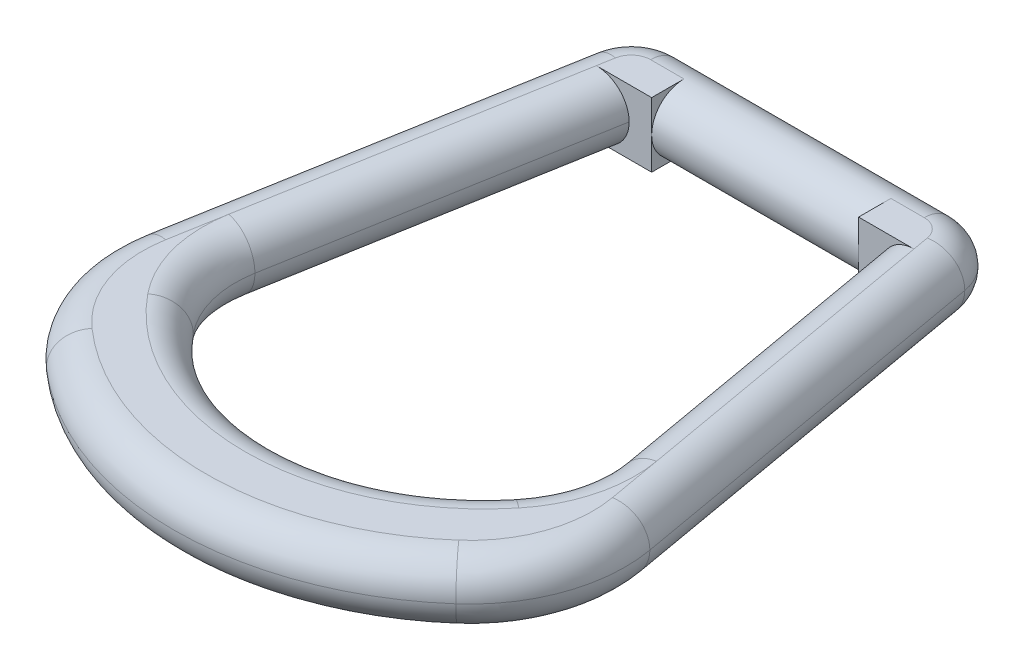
ISO-10303-21;
HEADER;
FILE_DESCRIPTION(('STEP AP214'),'2;1');
FILE_NAME('part.step','',(''),(''),'','','');
FILE_SCHEMA(('AUTOMOTIVE_DESIGN { 1 0 10303 214 1 1 1 1 }'));
ENDSEC;
DATA;
#1=APPLICATION_CONTEXT('core data for automotive mechanical design processes');
#2=APPLICATION_PROTOCOL_DEFINITION('international standard','automotive_design',2000,#1);
#3=PRODUCT_CONTEXT('',#1,'mechanical');
#4=PRODUCT('Part','Part','',(#3));
#5=PRODUCT_RELATED_PRODUCT_CATEGORY('part','',(#4));
#6=PRODUCT_DEFINITION_FORMATION('','',#4);
#7=PRODUCT_DEFINITION_CONTEXT('part definition',#1,'design');
#8=PRODUCT_DEFINITION('design','',#6,#7);
#9=PRODUCT_DEFINITION_SHAPE('','',#8);
#10=(LENGTH_UNIT() NAMED_UNIT(*) SI_UNIT(.MILLI.,.METRE.));
#11=(NAMED_UNIT(*) PLANE_ANGLE_UNIT() SI_UNIT($,.RADIAN.));
#12=(NAMED_UNIT(*) SI_UNIT($,.STERADIAN.) SOLID_ANGLE_UNIT());
#13=UNCERTAINTY_MEASURE_WITH_UNIT(LENGTH_MEASURE(1.E-05),#10,'distance_accuracy_value','');
#14=(GEOMETRIC_REPRESENTATION_CONTEXT(3) GLOBAL_UNCERTAINTY_ASSIGNED_CONTEXT((#13)) GLOBAL_UNIT_ASSIGNED_CONTEXT((#10,
#11,#12)) REPRESENTATION_CONTEXT('',''));
#15=CARTESIAN_POINT('',(0.,0.,0.));
#16=DIRECTION('',(0.,0.,1.));
#17=DIRECTION('',(1.,0.,0.));
#18=AXIS2_PLACEMENT_3D('',#15,#16,#17);
#19=CARTESIAN_POINT('',(12.8,-30.9,-25.7));
#20=DIRECTION('',(1.,0.,0.));
#21=DIRECTION('',(0.,1.,0.));
#22=AXIS2_PLACEMENT_3D('',#19,#20,#21);
#23=PLANE('',#22);
#24=DIRECTION('',(0.,0.,1.));
#25=VECTOR('',#24,1.);
#26=CARTESIAN_POINT('',(12.8,4.,10.));
#27=LINE('',#26,#25);
#28=CARTESIAN_POINT('',(12.8,4.,0.));
#29=VERTEX_POINT('',#28);
#30=CARTESIAN_POINT('',(12.8,4.,4.));
#31=VERTEX_POINT('',#30);
#32=EDGE_CURVE('E254',#29,#31,#27,.T.);
#33=ORIENTED_EDGE('',*,*,#32,.F.);
#34=CARTESIAN_POINT('',(12.8,0.,0.));
#35=DIRECTION('',(1.,0.,0.));
#36=DIRECTION('',(0.,1.,0.));
#37=AXIS2_PLACEMENT_3D('',#34,#35,#36);
#38=CIRCLE('',#37,4.);
#39=CARTESIAN_POINT('',(12.8,0.,4.));
#40=VERTEX_POINT('',#39);
#41=EDGE_CURVE('E31',#29,#40,#38,.T.);
#42=ORIENTED_EDGE('',*,*,#41,.T.);
#43=DIRECTION('',(0.,-1.,0.));
#44=VECTOR('',#43,1.);
#45=CARTESIAN_POINT('',(12.8,10.,4.));
#46=LINE('',#45,#44);
#47=EDGE_CURVE('E343',#31,#40,#46,.T.);
#48=ORIENTED_EDGE('',*,*,#47,.F.);
#49=EDGE_LOOP('',(#33,#42,#48));
#50=FACE_BOUND('',#49,.T.);
#51=ADVANCED_FACE('F14',(#50),#23,.F.);
#52=CARTESIAN_POINT('',(-12.8,-30.9,-25.7));
#53=DIRECTION('',(-1.,0.,0.));
#54=DIRECTION('',(0.,-1.,0.));
#55=AXIS2_PLACEMENT_3D('',#52,#53,#54);
#56=PLANE('',#55);
#57=CARTESIAN_POINT('',(-12.8,0.,0.));
#58=DIRECTION('',(1.,0.,0.));
#59=DIRECTION('',(0.,1.,0.));
#60=AXIS2_PLACEMENT_3D('',#57,#58,#59);
#61=CIRCLE('',#60,4.);
#62=CARTESIAN_POINT('',(-12.8,4.,0.));
#63=VERTEX_POINT('',#62);
#64=CARTESIAN_POINT('',(-12.8,0.,4.));
#65=VERTEX_POINT('',#64);
#66=EDGE_CURVE('E198',#63,#65,#61,.T.);
#67=ORIENTED_EDGE('',*,*,#66,.F.);
#68=DIRECTION('',(0.,0.,-1.));
#69=VECTOR('',#68,1.);
#70=CARTESIAN_POINT('',(-12.8,4.,10.));
#71=LINE('',#70,#69);
#72=CARTESIAN_POINT('',(-12.8,4.,4.));
#73=VERTEX_POINT('',#72);
#74=EDGE_CURVE('E209',#73,#63,#71,.T.);
#75=ORIENTED_EDGE('',*,*,#74,.F.);
#76=DIRECTION('',(0.,1.,0.));
#77=VECTOR('',#76,1.);
#78=CARTESIAN_POINT('',(-12.8,10.,4.));
#79=LINE('',#78,#77);
#80=EDGE_CURVE('E214',#65,#73,#79,.T.);
#81=ORIENTED_EDGE('',*,*,#80,.F.);
#82=EDGE_LOOP('',(#67,#75,#81));
#83=FACE_BOUND('',#82,.T.);
#84=ADVANCED_FACE('F217',(#83),#56,.F.);
#85=CARTESIAN_POINT('',(-12.8,-4.,0.));
#86=VERTEX_POINT('',#85);
#87=EDGE_CURVE('E23',#65,#86,#61,.T.);
#88=ORIENTED_EDGE('',*,*,#87,.F.);
#89=CARTESIAN_POINT('',(-12.8,-4.,4.));
#90=VERTEX_POINT('',#89);
#91=EDGE_CURVE('E239',#90,#65,#79,.T.);
#92=ORIENTED_EDGE('',*,*,#91,.F.);
#93=DIRECTION('',(0.,0.,-1.));
#94=VECTOR('',#93,1.);
#95=CARTESIAN_POINT('',(-12.8,-4.,10.));
#96=LINE('',#95,#94);
#97=EDGE_CURVE('E236',#90,#86,#96,.T.);
#98=ORIENTED_EDGE('',*,*,#97,.T.);
#99=EDGE_LOOP('',(#88,#92,#98));
#100=FACE_BOUND('',#99,.T.);
#101=ADVANCED_FACE('F534',(#100),#56,.F.);
#102=CARTESIAN_POINT('',(-16.9297623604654,-4.,2.4));
#103=DIRECTION('',(0.,-1.,0.));
#104=DIRECTION('',(1.,0.,0.));
#105=AXIS2_PLACEMENT_3D('',#102,#103,#104);
#106=PLANE('',#105);
#107=DIRECTION('',(-1.,0.,0.));
#108=VECTOR('',#107,1.);
#109=CARTESIAN_POINT('',(-15.5872029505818,-4.,4.));
#110=LINE('',#109,#108);
#111=CARTESIAN_POINT('',(-19.6489093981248,-4.,4.));
#112=VERTEX_POINT('',#111);
#113=EDGE_CURVE('E338',#90,#112,#110,.T.);
#114=ORIENTED_EDGE('',*,*,#113,.T.);
#115=DIRECTION('',(0.173648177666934,0.,-0.984807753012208));
#116=VECTOR('',#115,1.);
#117=CARTESIAN_POINT('',(-19.2933009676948,-4.,1.9832443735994));
#118=LINE('',#117,#116);
#119=CARTESIAN_POINT('',(-19.2933009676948,-4.,1.98324437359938));
#120=VERTEX_POINT('',#119);
#121=EDGE_CURVE('E271',#112,#120,#118,.T.);
#122=ORIENTED_EDGE('',*,*,#121,.T.);
#123=CARTESIAN_POINT('',(-16.9297623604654,-4.,2.4));
#124=DIRECTION('',(0.,-1.,0.));
#125=DIRECTION('',(1.,0.,0.));
#126=AXIS2_PLACEMENT_3D('',#123,#124,#125);
#127=CIRCLE('',#126,2.4);
#128=CARTESIAN_POINT('',(-16.9297623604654,-4.,0.));
#129=VERTEX_POINT('',#128);
#130=EDGE_CURVE('E246',#120,#129,#127,.T.);
#131=ORIENTED_EDGE('',*,*,#130,.T.);
#132=DIRECTION('',(1.,0.,0.));
#133=VECTOR('',#132,1.);
#134=CARTESIAN_POINT('',(-12.8,-4.,0.));
#135=LINE('',#134,#133);
#136=EDGE_CURVE('E242',#129,#86,#135,.T.);
#137=ORIENTED_EDGE('',*,*,#136,.T.);
#138=ORIENTED_EDGE('',*,*,#97,.F.);
#139=EDGE_LOOP('',(#114,#122,#131,#137,#138));
#140=FACE_BOUND('',#139,.T.);
#141=ADVANCED_FACE('F545',(#140),#106,.T.);
#142=DIRECTION('',(0.,0.,1.));
#143=VECTOR('',#142,1.);
#144=CARTESIAN_POINT('',(12.8,-4.,10.));
#145=LINE('',#144,#143);
#146=CARTESIAN_POINT('',(12.8,-4.,0.));
#147=VERTEX_POINT('',#146);
#148=CARTESIAN_POINT('',(12.8,-4.,4.));
#149=VERTEX_POINT('',#148);
#150=EDGE_CURVE('E215',#147,#149,#145,.T.);
#151=ORIENTED_EDGE('',*,*,#150,.F.);
#152=DIRECTION('',(1.,0.,0.));
#153=VECTOR('',#152,1.);
#154=CARTESIAN_POINT('',(16.9297623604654,-4.,0.));
#155=LINE('',#154,#153);
#156=CARTESIAN_POINT('',(16.9297623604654,-4.,0.));
#157=VERTEX_POINT('',#156);
#158=EDGE_CURVE('E270',#147,#157,#155,.T.);
#159=ORIENTED_EDGE('',*,*,#158,.T.);
#160=CARTESIAN_POINT('',(16.9297623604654,-4.,2.4));
#161=DIRECTION('',(0.,-1.,0.));
#162=DIRECTION('',(1.,0.,0.));
#163=AXIS2_PLACEMENT_3D('',#160,#161,#162);
#164=CIRCLE('',#163,2.4);
#165=CARTESIAN_POINT('',(19.2933009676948,-4.,1.98324437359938));
#166=VERTEX_POINT('',#165);
#167=EDGE_CURVE('E272',#157,#166,#164,.T.);
#168=ORIENTED_EDGE('',*,*,#167,.T.);
#169=DIRECTION('',(0.173648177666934,0.,0.984807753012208));
#170=VECTOR('',#169,1.);
#171=CARTESIAN_POINT('',(27.6348189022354,-4.,49.2903433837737));
#172=LINE('',#171,#170);
#173=CARTESIAN_POINT('',(19.6489093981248,-4.,4.));
#174=VERTEX_POINT('',#173);
#175=EDGE_CURVE('E278',#166,#174,#172,.T.);
#176=ORIENTED_EDGE('',*,*,#175,.T.);
#177=DIRECTION('',(-1.,0.,0.));
#178=VECTOR('',#177,1.);
#179=CARTESIAN_POINT('',(15.5872029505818,-4.,4.));
#180=LINE('',#179,#178);
#181=EDGE_CURVE('E257',#174,#149,#180,.T.);
#182=ORIENTED_EDGE('',*,*,#181,.T.);
#183=EDGE_LOOP('',(#151,#159,#168,#176,#182));
#184=FACE_BOUND('',#183,.T.);
#185=ADVANCED_FACE('F543',(#184),#106,.T.);
#186=CARTESIAN_POINT('',(-16.9297623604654,4.,2.4));
#187=DIRECTION('',(0.,-1.,0.));
#188=DIRECTION('',(1.,0.,0.));
#189=AXIS2_PLACEMENT_3D('',#186,#187,#188);
#190=PLANE('',#189);
#191=CARTESIAN_POINT('',(16.9297623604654,4.,2.4));
#192=DIRECTION('',(0.,-1.,0.));
#193=DIRECTION('',(1.,0.,0.));
#194=AXIS2_PLACEMENT_3D('',#191,#192,#193);
#195=CIRCLE('',#194,2.4);
#196=CARTESIAN_POINT('',(19.2933009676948,4.,1.98324437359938));
#197=VERTEX_POINT('',#196);
#198=CARTESIAN_POINT('',(16.9297623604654,4.,0.));
#199=VERTEX_POINT('',#198);
#200=EDGE_CURVE('E264',#197,#199,#195,.F.);
#201=ORIENTED_EDGE('',*,*,#200,.T.);
#202=DIRECTION('',(1.,0.,0.));
#203=VECTOR('',#202,1.);
#204=CARTESIAN_POINT('',(-16.9297623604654,4.,0.));
#205=LINE('',#204,#203);
#206=EDGE_CURVE('E260',#199,#29,#205,.F.);
#207=ORIENTED_EDGE('',*,*,#206,.T.);
#208=ORIENTED_EDGE('',*,*,#32,.T.);
#209=DIRECTION('',(-1.,0.,0.));
#210=VECTOR('',#209,1.);
#211=CARTESIAN_POINT('',(15.5872029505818,4.,4.));
#212=LINE('',#211,#210);
#213=CARTESIAN_POINT('',(19.6489093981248,4.,4.));
#214=VERTEX_POINT('',#213);
#215=EDGE_CURVE('E335',#214,#31,#212,.T.);
#216=ORIENTED_EDGE('',*,*,#215,.F.);
#217=DIRECTION('',(0.173648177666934,0.,0.984807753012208));
#218=VECTOR('',#217,1.);
#219=CARTESIAN_POINT('',(18.2723113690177,4.,-3.80707537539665));
#220=LINE('',#219,#218);
#221=EDGE_CURVE('E204',#214,#197,#220,.F.);
#222=ORIENTED_EDGE('',*,*,#221,.T.);
#223=EDGE_LOOP('',(#201,#207,#208,#216,#222));
#224=FACE_BOUND('',#223,.T.);
#225=ADVANCED_FACE('F525',(#224),#190,.F.);
#226=ORIENTED_EDGE('',*,*,#74,.T.);
#227=DIRECTION('',(1.,0.,0.));
#228=VECTOR('',#227,1.);
#229=CARTESIAN_POINT('',(-16.9297623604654,4.,0.));
#230=LINE('',#229,#228);
#231=CARTESIAN_POINT('',(-16.9297623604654,4.,0.));
#232=VERTEX_POINT('',#231);
#233=EDGE_CURVE('E193',#63,#232,#230,.F.);
#234=ORIENTED_EDGE('',*,*,#233,.T.);
#235=CARTESIAN_POINT('',(-16.9297623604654,4.,2.4));
#236=DIRECTION('',(0.,-1.,0.));
#237=DIRECTION('',(1.,0.,0.));
#238=AXIS2_PLACEMENT_3D('',#235,#236,#237);
#239=CIRCLE('',#238,2.4);
#240=CARTESIAN_POINT('',(-19.2933009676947,4.,1.98324437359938));
#241=VERTEX_POINT('',#240);
#242=EDGE_CURVE('E205',#232,#241,#239,.F.);
#243=ORIENTED_EDGE('',*,*,#242,.T.);
#244=DIRECTION('',(0.173648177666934,0.,-0.984807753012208));
#245=VECTOR('',#244,1.);
#246=CARTESIAN_POINT('',(-19.2933009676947,4.,1.98324437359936));
#247=LINE('',#246,#245);
#248=CARTESIAN_POINT('',(-19.6489093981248,4.,4.));
#249=VERTEX_POINT('',#248);
#250=EDGE_CURVE('E363',#241,#249,#247,.F.);
#251=ORIENTED_EDGE('',*,*,#250,.T.);
#252=DIRECTION('',(-1.,0.,0.));
#253=VECTOR('',#252,1.);
#254=CARTESIAN_POINT('',(-15.5872029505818,4.,4.));
#255=LINE('',#254,#253);
#256=EDGE_CURVE('E212',#73,#249,#255,.T.);
#257=ORIENTED_EDGE('',*,*,#256,.F.);
#258=EDGE_LOOP('',(#226,#234,#243,#251,#257));
#259=FACE_BOUND('',#258,.T.);
#260=ADVANCED_FACE('F210',(#259),#190,.F.);
#261=CARTESIAN_POINT('',(15.5872029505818,-4.,4.));
#262=DIRECTION('',(0.,0.,-1.));
#263=DIRECTION('',(0.,-1.,0.));
#264=AXIS2_PLACEMENT_3D('',#261,#262,#263);
#265=PLANE('',#264);
#266=ORIENTED_EDGE('',*,*,#215,.T.);
#267=ORIENTED_EDGE('',*,*,#47,.T.);
#268=EDGE_CURVE('E238',#40,#149,#46,.T.);
#269=ORIENTED_EDGE('',*,*,#268,.T.);
#270=ORIENTED_EDGE('',*,*,#181,.F.);
#271=CARTESIAN_POINT('',(19.6489093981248,0.,4.));
#272=DIRECTION('',(0.,0.,-1.));
#273=DIRECTION('',(1.,0.,0.));
#274=AXIS2_PLACEMENT_3D('',#271,#272,#273);
#275=ELLIPSE('',#274,4.06170644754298,4.);
#276=CARTESIAN_POINT('',(15.5872029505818,0.,4.));
#277=VERTEX_POINT('',#276);
#278=EDGE_CURVE('E291',#174,#277,#275,.T.);
#279=ORIENTED_EDGE('',*,*,#278,.T.);
#280=CARTESIAN_POINT('',(19.6489093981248,0.,4.));
#281=DIRECTION('',(0.,0.,-1.));
#282=DIRECTION('',(-1.,0.,0.));
#283=AXIS2_PLACEMENT_3D('',#280,#281,#282);
#284=ELLIPSE('',#283,4.06170644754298,4.);
#285=EDGE_CURVE('E289',#277,#214,#284,.T.);
#286=ORIENTED_EDGE('',*,*,#285,.T.);
#287=EDGE_LOOP('',(#266,#267,#269,#270,#279,#286));
#288=FACE_BOUND('',#287,.T.);
#289=ADVANCED_FACE('F523',(#288),#265,.F.);
#290=CARTESIAN_POINT('',(-15.5872029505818,-4.,4.));
#291=DIRECTION('',(0.,0.,-1.));
#292=DIRECTION('',(0.,-1.,0.));
#293=AXIS2_PLACEMENT_3D('',#290,#291,#292);
#294=PLANE('',#293);
#295=ORIENTED_EDGE('',*,*,#113,.F.);
#296=ORIENTED_EDGE('',*,*,#91,.T.);
#297=ORIENTED_EDGE('',*,*,#80,.T.);
#298=ORIENTED_EDGE('',*,*,#256,.T.);
#299=CARTESIAN_POINT('',(-19.6489093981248,0.,4.));
#300=DIRECTION('',(0.,0.,-1.));
#301=DIRECTION('',(-1.,0.,0.));
#302=AXIS2_PLACEMENT_3D('',#299,#300,#301);
#303=ELLIPSE('',#302,4.06170644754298,4.);
#304=CARTESIAN_POINT('',(-15.5872029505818,0.,4.));
#305=VERTEX_POINT('',#304);
#306=EDGE_CURVE('E227',#249,#305,#303,.T.);
#307=ORIENTED_EDGE('',*,*,#306,.T.);
#308=CARTESIAN_POINT('',(-19.6489093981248,0.,4.));
#309=DIRECTION('',(0.,0.,-1.));
#310=DIRECTION('',(1.,0.,0.));
#311=AXIS2_PLACEMENT_3D('',#308,#309,#310);
#312=ELLIPSE('',#311,4.06170644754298,4.);
#313=EDGE_CURVE('E245',#305,#112,#312,.T.);
#314=ORIENTED_EDGE('',*,*,#313,.T.);
#315=EDGE_LOOP('',(#295,#296,#297,#298,#307,#314));
#316=FACE_BOUND('',#315,.T.);
#317=ADVANCED_FACE('F16',(#316),#294,.F.);
#318=CARTESIAN_POINT('',(0.,-4.,37.5));
#319=DIRECTION('',(0.,-1.,0.));
#320=DIRECTION('',(1.,0.,0.));
#321=AXIS2_PLACEMENT_3D('',#318,#319,#320);
#322=CIRCLE('',#321,34.4);
#323=CARTESIAN_POINT('',(22.6927860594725,-4.,63.3533839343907));
#324=VERTEX_POINT('',#323);
#325=CARTESIAN_POINT('',(-22.6927860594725,-4.,63.3533839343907));
#326=VERTEX_POINT('',#325);
#327=EDGE_CURVE('E373',#324,#326,#322,.T.);
#328=ORIENTED_EDGE('',*,*,#327,.T.);
#329=CARTESIAN_POINT('',(-12.6657410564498,-4.,51.9297956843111));
#330=DIRECTION('',(0.,-1.,0.));
#331=DIRECTION('',(1.,0.,0.));
#332=AXIS2_PLACEMENT_3D('',#329,#330,#331);
#333=CIRCLE('',#332,15.2);
#334=CARTESIAN_POINT('',(-27.6348189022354,-4.,49.2903433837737));
#335=VERTEX_POINT('',#334);
#336=EDGE_CURVE('E282',#326,#335,#333,.T.);
#337=ORIENTED_EDGE('',*,*,#336,.T.);
#338=DIRECTION('',(0.173648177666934,0.,-0.984807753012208));
#339=VECTOR('',#338,1.);
#340=CARTESIAN_POINT('',(-19.2933009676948,-4.,1.9832443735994));
#341=LINE('',#340,#339);
#342=CARTESIAN_POINT('',(-26.4672559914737,-4.,42.6687650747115));
#343=VERTEX_POINT('',#342);
#344=EDGE_CURVE('E380',#335,#343,#341,.T.);
#345=ORIENTED_EDGE('',*,*,#344,.T.);
#346=CARTESIAN_POINT('',(-9.92248574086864,-4.,45.586054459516));
#347=DIRECTION('',(0.,-1.,0.));
#348=DIRECTION('',(1.,0.,0.));
#349=AXIS2_PLACEMENT_3D('',#346,#347,#348);
#350=CIRCLE('',#349,16.8);
#351=CARTESIAN_POINT('',(-22.9457482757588,-4.,56.1990009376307));
#352=VERTEX_POINT('',#351);
#353=EDGE_CURVE('E377',#343,#352,#350,.F.);
#354=ORIENTED_EDGE('',*,*,#353,.T.);
#355=CARTESIAN_POINT('',(0.,-4.,37.5));
#356=DIRECTION('',(0.,-1.,0.));
#357=DIRECTION('',(1.,0.,0.));
#358=AXIS2_PLACEMENT_3D('',#355,#356,#357);
#359=CIRCLE('',#358,29.6);
#360=CARTESIAN_POINT('',(22.9457482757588,-4.,56.1990009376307));
#361=VERTEX_POINT('',#360);
#362=EDGE_CURVE('E375',#352,#361,#359,.F.);
#363=ORIENTED_EDGE('',*,*,#362,.T.);
#364=CARTESIAN_POINT('',(9.92248574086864,-4.,45.586054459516));
#365=DIRECTION('',(0.,-1.,0.));
#366=DIRECTION('',(1.,0.,0.));
#367=AXIS2_PLACEMENT_3D('',#364,#365,#366);
#368=CIRCLE('',#367,16.8);
#369=CARTESIAN_POINT('',(26.4672559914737,-4.,42.6687650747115));
#370=VERTEX_POINT('',#369);
#371=EDGE_CURVE('E371',#361,#370,#368,.F.);
#372=ORIENTED_EDGE('',*,*,#371,.T.);
#373=DIRECTION('',(0.173648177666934,0.,0.984807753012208));
#374=VECTOR('',#373,1.);
#375=CARTESIAN_POINT('',(27.6348189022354,-4.,49.2903433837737));
#376=LINE('',#375,#374);
#377=CARTESIAN_POINT('',(27.6348189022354,-4.,49.2903433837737));
#378=VERTEX_POINT('',#377);
#379=EDGE_CURVE('E263',#370,#378,#376,.T.);
#380=ORIENTED_EDGE('',*,*,#379,.T.);
#381=CARTESIAN_POINT('',(12.6657410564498,-4.,51.9297956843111));
#382=DIRECTION('',(0.,-1.,0.));
#383=DIRECTION('',(1.,0.,0.));
#384=AXIS2_PLACEMENT_3D('',#381,#382,#383);
#385=CIRCLE('',#384,15.2);
#386=EDGE_CURVE('E369',#378,#324,#385,.T.);
#387=ORIENTED_EDGE('',*,*,#386,.T.);
#388=EDGE_LOOP('',(#328,#337,#345,#354,#363,#372,#380,#387));
#389=FACE_BOUND('',#388,.T.);
#390=ADVANCED_FACE('F384',(#389),#106,.T.);
#391=DIRECTION('',(0.173648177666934,0.,0.984807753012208));
#392=VECTOR('',#391,1.);
#393=CARTESIAN_POINT('',(18.2723113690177,4.,-3.80707537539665));
#394=LINE('',#393,#392);
#395=CARTESIAN_POINT('',(27.6348189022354,4.,49.2903433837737));
#396=VERTEX_POINT('',#395);
#397=CARTESIAN_POINT('',(26.4672559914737,4.,42.6687650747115));
#398=VERTEX_POINT('',#397);
#399=EDGE_CURVE('E358',#396,#398,#394,.F.);
#400=ORIENTED_EDGE('',*,*,#399,.T.);
#401=CARTESIAN_POINT('',(9.92248574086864,4.,45.586054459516));
#402=DIRECTION('',(0.,-1.,0.));
#403=DIRECTION('',(1.,0.,0.));
#404=AXIS2_PLACEMENT_3D('',#401,#402,#403);
#405=CIRCLE('',#404,16.8);
#406=CARTESIAN_POINT('',(22.9457482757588,4.,56.1990009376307));
#407=VERTEX_POINT('',#406);
#408=EDGE_CURVE('E361',#398,#407,#405,.T.);
#409=ORIENTED_EDGE('',*,*,#408,.T.);
#410=CARTESIAN_POINT('',(0.,4.,37.5));
#411=DIRECTION('',(0.,-1.,0.));
#412=DIRECTION('',(1.,0.,0.));
#413=AXIS2_PLACEMENT_3D('',#410,#411,#412);
#414=CIRCLE('',#413,29.6);
#415=CARTESIAN_POINT('',(-22.9457482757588,4.,56.1990009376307));
#416=VERTEX_POINT('',#415);
#417=EDGE_CURVE('E354',#407,#416,#414,.T.);
#418=ORIENTED_EDGE('',*,*,#417,.T.);
#419=CARTESIAN_POINT('',(-9.92248574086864,4.,45.586054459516));
#420=DIRECTION('',(0.,-1.,0.));
#421=DIRECTION('',(1.,0.,0.));
#422=AXIS2_PLACEMENT_3D('',#419,#420,#421);
#423=CIRCLE('',#422,16.8);
#424=CARTESIAN_POINT('',(-26.4672559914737,4.,42.6687650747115));
#425=VERTEX_POINT('',#424);
#426=EDGE_CURVE('E350',#416,#425,#423,.T.);
#427=ORIENTED_EDGE('',*,*,#426,.T.);
#428=DIRECTION('',(0.173648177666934,0.,-0.984807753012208));
#429=VECTOR('',#428,1.);
#430=CARTESIAN_POINT('',(-19.2933009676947,4.,1.98324437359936));
#431=LINE('',#430,#429);
#432=CARTESIAN_POINT('',(-27.6348189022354,4.,49.2903433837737));
#433=VERTEX_POINT('',#432);
#434=EDGE_CURVE('E346',#425,#433,#431,.F.);
#435=ORIENTED_EDGE('',*,*,#434,.T.);
#436=CARTESIAN_POINT('',(-12.6657410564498,4.,51.9297956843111));
#437=DIRECTION('',(0.,-1.,0.));
#438=DIRECTION('',(1.,0.,0.));
#439=AXIS2_PLACEMENT_3D('',#436,#437,#438);
#440=CIRCLE('',#439,15.2);
#441=CARTESIAN_POINT('',(-22.6927860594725,4.,63.3533839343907));
#442=VERTEX_POINT('',#441);
#443=EDGE_CURVE('E348',#433,#442,#440,.F.);
#444=ORIENTED_EDGE('',*,*,#443,.T.);
#445=CARTESIAN_POINT('',(0.,4.,37.5));
#446=DIRECTION('',(0.,-1.,0.));
#447=DIRECTION('',(1.,0.,0.));
#448=AXIS2_PLACEMENT_3D('',#445,#446,#447);
#449=CIRCLE('',#448,34.4);
#450=CARTESIAN_POINT('',(22.6927860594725,4.,63.3533839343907));
#451=VERTEX_POINT('',#450);
#452=EDGE_CURVE('E352',#442,#451,#449,.F.);
#453=ORIENTED_EDGE('',*,*,#452,.T.);
#454=CARTESIAN_POINT('',(12.6657410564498,4.,51.9297956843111));
#455=DIRECTION('',(0.,-1.,0.));
#456=DIRECTION('',(1.,0.,0.));
#457=AXIS2_PLACEMENT_3D('',#454,#455,#456);
#458=CIRCLE('',#457,15.2);
#459=EDGE_CURVE('E356',#451,#396,#458,.F.);
#460=ORIENTED_EDGE('',*,*,#459,.T.);
#461=EDGE_LOOP('',(#400,#409,#418,#427,#435,#444,#453,#460));
#462=FACE_BOUND('',#461,.T.);
#463=ADVANCED_FACE('F553',(#462),#190,.F.);
#464=CARTESIAN_POINT('',(-16.9297623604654,0.,0.));
#465=DIRECTION('',(-1.,0.,0.));
#466=DIRECTION('',(0.,-1.,0.));
#467=AXIS2_PLACEMENT_3D('',#464,#465,#466);
#468=CYLINDRICAL_SURFACE('',#467,4.);
#469=DIRECTION('',(1.,0.,0.));
#470=VECTOR('',#469,1.);
#471=CARTESIAN_POINT('',(-16.9297623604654,0.,-4.));
#472=LINE('',#471,#470);
#473=CARTESIAN_POINT('',(-12.8,0.,-4.));
#474=VERTEX_POINT('',#473);
#475=CARTESIAN_POINT('',(-16.9297623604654,0.,-4.));
#476=VERTEX_POINT('',#475);
#477=EDGE_CURVE('E330',#474,#476,#472,.F.);
#478=ORIENTED_EDGE('',*,*,#477,.F.);
#479=ORIENTED_EDGE('',*,*,#477,.T.);
#480=CARTESIAN_POINT('',(-16.9297623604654,0.,0.));
#481=DIRECTION('',(-1.,0.,0.));
#482=DIRECTION('',(0.,-1.,0.));
#483=AXIS2_PLACEMENT_3D('',#480,#481,#482);
#484=CIRCLE('',#483,4.);
#485=EDGE_CURVE('E201',#232,#476,#484,.T.);
#486=ORIENTED_EDGE('',*,*,#485,.F.);
#487=ORIENTED_EDGE('',*,*,#233,.F.);
#488=ORIENTED_EDGE('',*,*,#66,.T.);
#489=ORIENTED_EDGE('',*,*,#87,.T.);
#490=ORIENTED_EDGE('',*,*,#136,.F.);
#491=CARTESIAN_POINT('',(-16.9297623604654,0.,0.));
#492=DIRECTION('',(-1.,0.,0.));
#493=DIRECTION('',(0.,-1.,0.));
#494=AXIS2_PLACEMENT_3D('',#491,#492,#493);
#495=CIRCLE('',#494,4.);
#496=EDGE_CURVE('E331',#476,#129,#495,.T.);
#497=ORIENTED_EDGE('',*,*,#496,.F.);
#498=EDGE_LOOP('',(#478,#479,#486,#487,#488,#489,#490,#497));
#499=FACE_BOUND('',#498,.T.);
#500=ORIENTED_EDGE('',*,*,#41,.F.);
#501=ORIENTED_EDGE('',*,*,#206,.F.);
#502=CARTESIAN_POINT('',(16.9297623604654,0.,0.));
#503=DIRECTION('',(-1.,0.,0.));
#504=DIRECTION('',(0.,-1.,0.));
#505=AXIS2_PLACEMENT_3D('',#502,#503,#504);
#506=CIRCLE('',#505,4.);
#507=CARTESIAN_POINT('',(16.9297623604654,0.,-4.));
#508=VERTEX_POINT('',#507);
#509=EDGE_CURVE('E220',#199,#508,#506,.T.);
#510=ORIENTED_EDGE('',*,*,#509,.T.);
#511=DIRECTION('',(1.,0.,0.));
#512=VECTOR('',#511,1.);
#513=CARTESIAN_POINT('',(12.8,0.,-4.));
#514=LINE('',#513,#512);
#515=CARTESIAN_POINT('',(12.8,0.,-4.));
#516=VERTEX_POINT('',#515);
#517=EDGE_CURVE('E249',#508,#516,#514,.F.);
#518=ORIENTED_EDGE('',*,*,#517,.T.);
#519=ORIENTED_EDGE('',*,*,#517,.F.);
#520=CARTESIAN_POINT('',(16.9297623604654,0.,0.));
#521=DIRECTION('',(-1.,0.,0.));
#522=DIRECTION('',(0.,-1.,0.));
#523=AXIS2_PLACEMENT_3D('',#520,#521,#522);
#524=CIRCLE('',#523,4.);
#525=EDGE_CURVE('E474',#508,#157,#524,.T.);
#526=ORIENTED_EDGE('',*,*,#525,.T.);
#527=ORIENTED_EDGE('',*,*,#158,.F.);
#528=EDGE_CURVE('E9',#40,#147,#38,.T.);
#529=ORIENTED_EDGE('',*,*,#528,.F.);
#530=EDGE_LOOP('',(#500,#501,#510,#518,#519,#526,#527,#529));
#531=FACE_BOUND('',#530,.T.);
#532=ADVANCED_FACE('F195',(#499,#531),#468,.T.);
#533=CARTESIAN_POINT('',(-16.9297623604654,0.,2.4));
#534=DIRECTION('',(0.,-1.,0.));
#535=DIRECTION('',(1.,0.,0.));
#536=AXIS2_PLACEMENT_3D('',#533,#534,#535);
#537=DEGENERATE_TOROIDAL_SURFACE('',#536,2.4,4.,.T.);
#538=ORIENTED_EDGE('',*,*,#496,.T.);
#539=ORIENTED_EDGE('',*,*,#130,.F.);
#540=CARTESIAN_POINT('',(-19.2933009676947,0.,1.98324437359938));
#541=DIRECTION('',(-0.173648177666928,0.,0.984807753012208));
#542=DIRECTION('',(0.984807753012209,0.,0.173648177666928));
#543=AXIS2_PLACEMENT_3D('',#540,#541,#542);
#544=CIRCLE('',#543,4.);
#545=CARTESIAN_POINT('',(-23.2325319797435,0.,1.28865166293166));
#546=VERTEX_POINT('',#545);
#547=EDGE_CURVE('E326',#546,#120,#544,.T.);
#548=ORIENTED_EDGE('',*,*,#547,.F.);
#549=CARTESIAN_POINT('',(-16.9297623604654,0.,2.4));
#550=DIRECTION('',(0.,-1.,0.));
#551=DIRECTION('',(1.,0.,0.));
#552=AXIS2_PLACEMENT_3D('',#549,#550,#551);
#553=CIRCLE('',#552,6.4);
#554=EDGE_CURVE('E318',#476,#546,#553,.F.);
#555=ORIENTED_EDGE('',*,*,#554,.F.);
#556=EDGE_LOOP('',(#538,#539,#548,#555));
#557=FACE_BOUND('',#556,.T.);
#558=ADVANCED_FACE('F576',(#557),#537,.T.);
#559=CARTESIAN_POINT('',(-19.2933009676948,0.,1.98324437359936));
#560=DIRECTION('',(0.173648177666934,0.,-0.984807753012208));
#561=DIRECTION('',(-0.984807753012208,0.,-0.173648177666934));
#562=AXIS2_PLACEMENT_3D('',#559,#560,#561);
#563=CYLINDRICAL_SURFACE('',#562,4.);
#564=CARTESIAN_POINT('',(-26.4672559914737,0.,42.6687650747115));
#565=DIRECTION('',(-0.173648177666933,0.,0.984807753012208));
#566=DIRECTION('',(0.984807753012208,0.,0.173648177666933));
#567=AXIS2_PLACEMENT_3D('',#564,#565,#566);
#568=CIRCLE('',#567,4.);
#569=CARTESIAN_POINT('',(-22.5280249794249,0.,43.3633577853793));
#570=VERTEX_POINT('',#569);
#571=EDGE_CURVE('E316',#343,#570,#568,.T.);
#572=ORIENTED_EDGE('',*,*,#571,.F.);
#573=DIRECTION('',(-0.173648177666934,0.,0.984807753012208));
#574=VECTOR('',#573,1.);
#575=CARTESIAN_POINT('',(-26.4672559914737,-4.,42.6687650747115));
#576=LINE('',#575,#574);
#577=EDGE_CURVE('E310',#112,#343,#576,.T.);
#578=ORIENTED_EDGE('',*,*,#577,.F.);
#579=ORIENTED_EDGE('',*,*,#313,.F.);
#580=DIRECTION('',(-0.173648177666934,0.,0.984807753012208));
#581=VECTOR('',#580,1.);
#582=CARTESIAN_POINT('',(-15.5872029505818,0.,4.));
#583=LINE('',#582,#581);
#584=EDGE_CURVE('E307',#570,#305,#583,.F.);
#585=ORIENTED_EDGE('',*,*,#584,.F.);
#586=EDGE_LOOP('',(#572,#578,#579,#585));
#587=FACE_BOUND('',#586,.T.);
#588=ADVANCED_FACE('F306',(#587),#563,.T.);
#589=CARTESIAN_POINT('',(-19.2933009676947,0.,1.98324437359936));
#590=DIRECTION('',(-0.173648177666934,0.,0.984807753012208));
#591=DIRECTION('',(0.984807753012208,0.,0.173648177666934));
#592=AXIS2_PLACEMENT_3D('',#589,#590,#591);
#593=CYLINDRICAL_SURFACE('',#592,4.);
#594=ORIENTED_EDGE('',*,*,#577,.T.);
#595=ORIENTED_EDGE('',*,*,#344,.F.);
#596=CARTESIAN_POINT('',(-27.6348189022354,0.,49.2903433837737));
#597=DIRECTION('',(-0.173648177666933,0.,0.984807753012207));
#598=DIRECTION('',(0.984807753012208,0.,0.173648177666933));
#599=AXIS2_PLACEMENT_3D('',#596,#597,#598);
#600=CIRCLE('',#599,4.);
#601=CARTESIAN_POINT('',(-31.5740499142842,0.,48.5957506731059));
#602=VERTEX_POINT('',#601);
#603=EDGE_CURVE('E320',#602,#335,#600,.T.);
#604=ORIENTED_EDGE('',*,*,#603,.F.);
#605=DIRECTION('',(0.173648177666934,0.,-0.984807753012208));
#606=VECTOR('',#605,1.);
#607=CARTESIAN_POINT('',(-31.5740499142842,0.,48.595750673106));
#608=LINE('',#607,#606);
#609=EDGE_CURVE('E399',#546,#602,#608,.F.);
#610=ORIENTED_EDGE('',*,*,#609,.F.);
#611=ORIENTED_EDGE('',*,*,#547,.T.);
#612=ORIENTED_EDGE('',*,*,#121,.F.);
#613=EDGE_LOOP('',(#594,#595,#604,#610,#611,#612));
#614=FACE_BOUND('',#613,.T.);
#615=ADVANCED_FACE('F390',(#614),#593,.T.);
#616=CARTESIAN_POINT('',(-16.9297623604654,0.,2.4));
#617=DIRECTION('',(0.,-1.,0.));
#618=DIRECTION('',(1.,0.,0.));
#619=AXIS2_PLACEMENT_3D('',#616,#617,#618);
#620=DEGENERATE_TOROIDAL_SURFACE('',#619,2.4,4.,.T.);
#621=ORIENTED_EDGE('',*,*,#485,.T.);
#622=ORIENTED_EDGE('',*,*,#554,.T.);
#623=CARTESIAN_POINT('',(-19.2933009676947,0.,1.98324437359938));
#624=DIRECTION('',(-0.173648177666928,0.,0.984807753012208));
#625=DIRECTION('',(0.984807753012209,0.,0.173648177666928));
#626=AXIS2_PLACEMENT_3D('',#623,#624,#625);
#627=CIRCLE('',#626,4.);
#628=EDGE_CURVE('E400',#241,#546,#627,.T.);
#629=ORIENTED_EDGE('',*,*,#628,.F.);
#630=ORIENTED_EDGE('',*,*,#242,.F.);
#631=EDGE_LOOP('',(#621,#622,#629,#630));
#632=FACE_BOUND('',#631,.T.);
#633=ADVANCED_FACE('F584',(#632),#620,.T.);
#634=CARTESIAN_POINT('',(-26.4672559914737,0.,42.6687650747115));
#635=DIRECTION('',(-0.173648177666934,0.,0.984807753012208));
#636=DIRECTION('',(0.984807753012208,0.,0.173648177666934));
#637=AXIS2_PLACEMENT_3D('',#634,#635,#636);
#638=CYLINDRICAL_SURFACE('',#637,4.);
#639=ORIENTED_EDGE('',*,*,#584,.T.);
#640=ORIENTED_EDGE('',*,*,#306,.F.);
#641=DIRECTION('',(-0.173648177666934,0.,0.984807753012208));
#642=VECTOR('',#641,1.);
#643=CARTESIAN_POINT('',(-19.2933009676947,4.,1.98324437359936));
#644=LINE('',#643,#642);
#645=EDGE_CURVE('E405',#425,#249,#644,.F.);
#646=ORIENTED_EDGE('',*,*,#645,.F.);
#647=CARTESIAN_POINT('',(-26.4672559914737,0.,42.6687650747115));
#648=DIRECTION('',(-0.173648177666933,0.,0.984807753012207));
#649=DIRECTION('',(0.984807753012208,0.,0.173648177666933));
#650=AXIS2_PLACEMENT_3D('',#647,#648,#649);
#651=CIRCLE('',#650,4.);
#652=EDGE_CURVE('E314',#570,#425,#651,.T.);
#653=ORIENTED_EDGE('',*,*,#652,.F.);
#654=EDGE_LOOP('',(#639,#640,#646,#653));
#655=FACE_BOUND('',#654,.T.);
#656=ADVANCED_FACE('F312',(#655),#638,.T.);
#657=CARTESIAN_POINT('',(-9.92248574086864,0.,45.586054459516));
#658=DIRECTION('',(0.,-1.,0.));
#659=DIRECTION('',(1.,0.,0.));
#660=AXIS2_PLACEMENT_3D('',#657,#658,#659);
#661=TOROIDAL_SURFACE('',#660,16.8,4.);
#662=ORIENTED_EDGE('',*,*,#353,.F.);
#663=ORIENTED_EDGE('',*,*,#571,.T.);
#664=CARTESIAN_POINT('',(-9.92248574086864,0.,45.586054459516));
#665=DIRECTION('',(0.,-1.,0.));
#666=DIRECTION('',(1.,0.,0.));
#667=AXIS2_PLACEMENT_3D('',#664,#665,#666);
#668=CIRCLE('',#667,12.8);
#669=CARTESIAN_POINT('',(-19.8449714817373,0.,53.672108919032));
#670=VERTEX_POINT('',#669);
#671=EDGE_CURVE('E408',#670,#570,#668,.T.);
#672=ORIENTED_EDGE('',*,*,#671,.F.);
#673=CARTESIAN_POINT('',(-22.9457482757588,0.,56.1990009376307));
#674=DIRECTION('',(0.631723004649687,0.,0.775194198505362));
#675=DIRECTION('',(0.775194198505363,0.,-0.631723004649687));
#676=AXIS2_PLACEMENT_3D('',#673,#674,#675);
#677=CIRCLE('',#676,4.);
#678=EDGE_CURVE('E410',#352,#670,#677,.T.);
#679=ORIENTED_EDGE('',*,*,#678,.F.);
#680=EDGE_LOOP('',(#662,#663,#672,#679));
#681=FACE_BOUND('',#680,.T.);
#682=ADVANCED_FACE('F590',(#681),#661,.T.);
#683=CARTESIAN_POINT('',(-12.6657410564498,0.,51.9297956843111));
#684=DIRECTION('',(0.,-1.,0.));
#685=DIRECTION('',(1.,0.,0.));
#686=AXIS2_PLACEMENT_3D('',#683,#684,#685);
#687=TOROIDAL_SURFACE('',#686,15.2,4.);
#688=ORIENTED_EDGE('',*,*,#603,.T.);
#689=ORIENTED_EDGE('',*,*,#336,.F.);
#690=CARTESIAN_POINT('',(-22.6927860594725,0.,63.3533839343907));
#691=DIRECTION('',(0.751551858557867,0.,0.659674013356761));
#692=DIRECTION('',(0.659674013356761,0.,-0.751551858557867));
#693=AXIS2_PLACEMENT_3D('',#690,#691,#692);
#694=CIRCLE('',#693,4.);
#695=CARTESIAN_POINT('',(-25.3314821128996,0.,66.3595913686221));
#696=VERTEX_POINT('',#695);
#697=EDGE_CURVE('E413',#696,#326,#694,.T.);
#698=ORIENTED_EDGE('',*,*,#697,.F.);
#699=CARTESIAN_POINT('',(-12.6657410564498,0.,51.9297956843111));
#700=DIRECTION('',(0.,-1.,0.));
#701=DIRECTION('',(1.,0.,0.));
#702=AXIS2_PLACEMENT_3D('',#699,#700,#701);
#703=CIRCLE('',#702,19.2);
#704=EDGE_CURVE('E397',#602,#696,#703,.F.);
#705=ORIENTED_EDGE('',*,*,#704,.F.);
#706=EDGE_LOOP('',(#688,#689,#698,#705));
#707=FACE_BOUND('',#706,.T.);
#708=ADVANCED_FACE('F395',(#707),#687,.T.);
#709=CARTESIAN_POINT('',(-19.2933009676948,0.,1.9832443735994));
#710=DIRECTION('',(0.173648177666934,0.,-0.984807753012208));
#711=DIRECTION('',(-0.984807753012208,0.,-0.173648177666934));
#712=AXIS2_PLACEMENT_3D('',#709,#710,#711);
#713=CYLINDRICAL_SURFACE('',#712,4.);
#714=ORIENTED_EDGE('',*,*,#628,.T.);
#715=ORIENTED_EDGE('',*,*,#609,.T.);
#716=CARTESIAN_POINT('',(-27.6348189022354,0.,49.2903433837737));
#717=DIRECTION('',(-0.173648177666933,0.,0.984807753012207));
#718=DIRECTION('',(0.984807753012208,0.,0.173648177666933));
#719=AXIS2_PLACEMENT_3D('',#716,#717,#718);
#720=CIRCLE('',#719,4.);
#721=EDGE_CURVE('E416',#433,#602,#720,.T.);
#722=ORIENTED_EDGE('',*,*,#721,.F.);
#723=ORIENTED_EDGE('',*,*,#434,.F.);
#724=ORIENTED_EDGE('',*,*,#645,.T.);
#725=ORIENTED_EDGE('',*,*,#250,.F.);
#726=EDGE_LOOP('',(#714,#715,#722,#723,#724,#725));
#727=FACE_BOUND('',#726,.T.);
#728=ADVANCED_FACE('F596',(#727),#713,.T.);
#729=CARTESIAN_POINT('',(-9.92248574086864,0.,45.586054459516));
#730=DIRECTION('',(0.,-1.,0.));
#731=DIRECTION('',(1.,0.,0.));
#732=AXIS2_PLACEMENT_3D('',#729,#730,#731);
#733=TOROIDAL_SURFACE('',#732,16.8,4.);
#734=ORIENTED_EDGE('',*,*,#652,.T.);
#735=ORIENTED_EDGE('',*,*,#426,.F.);
#736=CARTESIAN_POINT('',(-22.9457482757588,0.,56.1990009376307));
#737=DIRECTION('',(0.631723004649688,0.,0.775194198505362));
#738=DIRECTION('',(0.775194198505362,0.,-0.631723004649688));
#739=AXIS2_PLACEMENT_3D('',#736,#737,#738);
#740=CIRCLE('',#739,4.);
#741=EDGE_CURVE('E418',#670,#416,#740,.T.);
#742=ORIENTED_EDGE('',*,*,#741,.F.);
#743=ORIENTED_EDGE('',*,*,#671,.T.);
#744=EDGE_LOOP('',(#734,#735,#742,#743));
#745=FACE_BOUND('',#744,.T.);
#746=ADVANCED_FACE('F599',(#745),#733,.T.);
#747=CARTESIAN_POINT('',(0.,0.,37.5));
#748=DIRECTION('',(0.,-1.,0.));
#749=DIRECTION('',(1.,0.,0.));
#750=AXIS2_PLACEMENT_3D('',#747,#748,#749);
#751=TOROIDAL_SURFACE('',#750,29.6,4.);
#752=ORIENTED_EDGE('',*,*,#362,.F.);
#753=ORIENTED_EDGE('',*,*,#678,.T.);
#754=CARTESIAN_POINT('',(0.,0.,37.5));
#755=DIRECTION('',(0.,-1.,0.));
#756=DIRECTION('',(1.,0.,0.));
#757=AXIS2_PLACEMENT_3D('',#754,#755,#756);
#758=CIRCLE('',#757,25.6);
#759=CARTESIAN_POINT('',(19.8449714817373,0.,53.672108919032));
#760=VERTEX_POINT('',#759);
#761=EDGE_CURVE('E421',#760,#670,#758,.T.);
#762=ORIENTED_EDGE('',*,*,#761,.F.);
#763=CARTESIAN_POINT('',(22.9457482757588,0.,56.1990009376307));
#764=DIRECTION('',(0.631723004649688,0.,-0.775194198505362));
#765=DIRECTION('',(-0.775194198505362,0.,-0.631723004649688));
#766=AXIS2_PLACEMENT_3D('',#763,#764,#765);
#767=CIRCLE('',#766,4.);
#768=EDGE_CURVE('E424',#361,#760,#767,.T.);
#769=ORIENTED_EDGE('',*,*,#768,.F.);
#770=EDGE_LOOP('',(#752,#753,#762,#769));
#771=FACE_BOUND('',#770,.T.);
#772=ADVANCED_FACE('F603',(#771),#751,.T.);
#773=CARTESIAN_POINT('',(0.,0.,37.5));
#774=DIRECTION('',(0.,-1.,0.));
#775=DIRECTION('',(1.,0.,0.));
#776=AXIS2_PLACEMENT_3D('',#773,#774,#775);
#777=TOROIDAL_SURFACE('',#776,34.4,4.);
#778=ORIENTED_EDGE('',*,*,#697,.T.);
#779=ORIENTED_EDGE('',*,*,#327,.F.);
#780=CARTESIAN_POINT('',(22.6927860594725,0.,63.3533839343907));
#781=DIRECTION('',(0.751551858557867,0.,-0.659674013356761));
#782=DIRECTION('',(-0.659674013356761,0.,-0.751551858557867));
#783=AXIS2_PLACEMENT_3D('',#780,#781,#782);
#784=CIRCLE('',#783,4.);
#785=CARTESIAN_POINT('',(25.3314821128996,0.,66.3595913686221));
#786=VERTEX_POINT('',#785);
#787=EDGE_CURVE('E427',#786,#324,#784,.T.);
#788=ORIENTED_EDGE('',*,*,#787,.F.);
#789=CARTESIAN_POINT('',(0.,0.,37.5));
#790=DIRECTION('',(0.,-1.,0.));
#791=DIRECTION('',(1.,0.,0.));
#792=AXIS2_PLACEMENT_3D('',#789,#790,#791);
#793=CIRCLE('',#792,38.4);
#794=EDGE_CURVE('E430',#696,#786,#793,.F.);
#795=ORIENTED_EDGE('',*,*,#794,.F.);
#796=EDGE_LOOP('',(#778,#779,#788,#795));
#797=FACE_BOUND('',#796,.T.);
#798=ADVANCED_FACE('F607',(#797),#777,.T.);
#799=CARTESIAN_POINT('',(-12.6657410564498,0.,51.9297956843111));
#800=DIRECTION('',(0.,-1.,0.));
#801=DIRECTION('',(1.,0.,0.));
#802=AXIS2_PLACEMENT_3D('',#799,#800,#801);
#803=TOROIDAL_SURFACE('',#802,15.2,4.);
#804=ORIENTED_EDGE('',*,*,#721,.T.);
#805=ORIENTED_EDGE('',*,*,#704,.T.);
#806=CARTESIAN_POINT('',(-22.6927860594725,0.,63.3533839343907));
#807=DIRECTION('',(0.751551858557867,0.,0.659674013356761));
#808=DIRECTION('',(0.659674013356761,0.,-0.751551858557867));
#809=AXIS2_PLACEMENT_3D('',#806,#807,#808);
#810=CIRCLE('',#809,4.);
#811=EDGE_CURVE('E433',#442,#696,#810,.T.);
#812=ORIENTED_EDGE('',*,*,#811,.F.);
#813=ORIENTED_EDGE('',*,*,#443,.F.);
#814=EDGE_LOOP('',(#804,#805,#812,#813));
#815=FACE_BOUND('',#814,.T.);
#816=ADVANCED_FACE('F611',(#815),#803,.T.);
#817=CARTESIAN_POINT('',(0.,0.,37.5));
#818=DIRECTION('',(0.,-1.,0.));
#819=DIRECTION('',(1.,0.,0.));
#820=AXIS2_PLACEMENT_3D('',#817,#818,#819);
#821=TOROIDAL_SURFACE('',#820,29.6,4.);
#822=ORIENTED_EDGE('',*,*,#741,.T.);
#823=ORIENTED_EDGE('',*,*,#417,.F.);
#824=CARTESIAN_POINT('',(22.9457482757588,0.,56.1990009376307));
#825=DIRECTION('',(0.631723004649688,0.,-0.775194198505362));
#826=DIRECTION('',(-0.775194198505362,0.,-0.631723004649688));
#827=AXIS2_PLACEMENT_3D('',#824,#825,#826);
#828=CIRCLE('',#827,4.);
#829=EDGE_CURVE('E436',#760,#407,#828,.T.);
#830=ORIENTED_EDGE('',*,*,#829,.F.);
#831=ORIENTED_EDGE('',*,*,#761,.T.);
#832=EDGE_LOOP('',(#822,#823,#830,#831));
#833=FACE_BOUND('',#832,.T.);
#834=ADVANCED_FACE('F615',(#833),#821,.T.);
#835=CARTESIAN_POINT('',(9.92248574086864,0.,45.586054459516));
#836=DIRECTION('',(0.,-1.,0.));
#837=DIRECTION('',(1.,0.,0.));
#838=AXIS2_PLACEMENT_3D('',#835,#836,#837);
#839=TOROIDAL_SURFACE('',#838,16.8,4.);
#840=ORIENTED_EDGE('',*,*,#371,.F.);
#841=ORIENTED_EDGE('',*,*,#768,.T.);
#842=CARTESIAN_POINT('',(9.92248574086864,0.,45.586054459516));
#843=DIRECTION('',(0.,-1.,0.));
#844=DIRECTION('',(1.,0.,0.));
#845=AXIS2_PLACEMENT_3D('',#842,#843,#844);
#846=CIRCLE('',#845,12.8);
#847=CARTESIAN_POINT('',(22.5280249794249,0.,43.3633577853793));
#848=VERTEX_POINT('',#847);
#849=EDGE_CURVE('E439',#848,#760,#846,.T.);
#850=ORIENTED_EDGE('',*,*,#849,.F.);
#851=CARTESIAN_POINT('',(26.4672559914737,0.,42.6687650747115));
#852=DIRECTION('',(-0.173648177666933,0.,-0.984807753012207));
#853=DIRECTION('',(-0.984807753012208,0.,0.173648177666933));
#854=AXIS2_PLACEMENT_3D('',#851,#852,#853);
#855=CIRCLE('',#854,4.);
#856=EDGE_CURVE('E442',#370,#848,#855,.T.);
#857=ORIENTED_EDGE('',*,*,#856,.F.);
#858=EDGE_LOOP('',(#840,#841,#850,#857));
#859=FACE_BOUND('',#858,.T.);
#860=ADVANCED_FACE('F515',(#859),#839,.T.);
#861=CARTESIAN_POINT('',(12.6657410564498,0.,51.9297956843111));
#862=DIRECTION('',(0.,-1.,0.));
#863=DIRECTION('',(1.,0.,0.));
#864=AXIS2_PLACEMENT_3D('',#861,#862,#863);
#865=TOROIDAL_SURFACE('',#864,15.2,4.);
#866=ORIENTED_EDGE('',*,*,#787,.T.);
#867=ORIENTED_EDGE('',*,*,#386,.F.);
#868=CARTESIAN_POINT('',(27.6348189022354,0.,49.2903433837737));
#869=DIRECTION('',(-0.173648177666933,0.,-0.984807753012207));
#870=DIRECTION('',(-0.984807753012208,0.,0.173648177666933));
#871=AXIS2_PLACEMENT_3D('',#868,#869,#870);
#872=CIRCLE('',#871,4.);
#873=CARTESIAN_POINT('',(31.5740499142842,0.,48.5957506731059));
#874=VERTEX_POINT('',#873);
#875=EDGE_CURVE('E448',#874,#378,#872,.T.);
#876=ORIENTED_EDGE('',*,*,#875,.F.);
#877=CARTESIAN_POINT('',(12.6657410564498,0.,51.9297956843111));
#878=DIRECTION('',(0.,-1.,0.));
#879=DIRECTION('',(1.,0.,0.));
#880=AXIS2_PLACEMENT_3D('',#877,#878,#879);
#881=CIRCLE('',#880,19.2);
#882=EDGE_CURVE('E451',#786,#874,#881,.F.);
#883=ORIENTED_EDGE('',*,*,#882,.F.);
#884=EDGE_LOOP('',(#866,#867,#876,#883));
#885=FACE_BOUND('',#884,.T.);
#886=ADVANCED_FACE('F507',(#885),#865,.T.);
#887=CARTESIAN_POINT('',(0.,0.,37.5));
#888=DIRECTION('',(0.,-1.,0.));
#889=DIRECTION('',(1.,0.,0.));
#890=AXIS2_PLACEMENT_3D('',#887,#888,#889);
#891=TOROIDAL_SURFACE('',#890,34.4,4.);
#892=ORIENTED_EDGE('',*,*,#811,.T.);
#893=ORIENTED_EDGE('',*,*,#794,.T.);
#894=CARTESIAN_POINT('',(22.6927860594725,0.,63.3533839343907));
#895=DIRECTION('',(0.751551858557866,0.,-0.659674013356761));
#896=DIRECTION('',(-0.659674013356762,0.,-0.751551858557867));
#897=AXIS2_PLACEMENT_3D('',#894,#895,#896);
#898=CIRCLE('',#897,4.);
#899=EDGE_CURVE('E454',#451,#786,#898,.T.);
#900=ORIENTED_EDGE('',*,*,#899,.F.);
#901=ORIENTED_EDGE('',*,*,#452,.F.);
#902=EDGE_LOOP('',(#892,#893,#900,#901));
#903=FACE_BOUND('',#902,.T.);
#904=ADVANCED_FACE('F624',(#903),#891,.T.);
#905=CARTESIAN_POINT('',(9.92248574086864,0.,45.586054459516));
#906=DIRECTION('',(0.,-1.,0.));
#907=DIRECTION('',(1.,0.,0.));
#908=AXIS2_PLACEMENT_3D('',#905,#906,#907);
#909=TOROIDAL_SURFACE('',#908,16.8,4.);
#910=ORIENTED_EDGE('',*,*,#829,.T.);
#911=ORIENTED_EDGE('',*,*,#408,.F.);
#912=CARTESIAN_POINT('',(26.4672559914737,0.,42.6687650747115));
#913=DIRECTION('',(-0.173648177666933,0.,-0.984807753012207));
#914=DIRECTION('',(-0.984807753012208,0.,0.173648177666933));
#915=AXIS2_PLACEMENT_3D('',#912,#913,#914);
#916=CIRCLE('',#915,4.);
#917=EDGE_CURVE('E457',#848,#398,#916,.T.);
#918=ORIENTED_EDGE('',*,*,#917,.F.);
#919=ORIENTED_EDGE('',*,*,#849,.T.);
#920=EDGE_LOOP('',(#910,#911,#918,#919));
#921=FACE_BOUND('',#920,.T.);
#922=ADVANCED_FACE('F627',(#921),#909,.T.);
#923=CARTESIAN_POINT('',(18.2723113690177,0.,-3.80707537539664));
#924=DIRECTION('',(0.173648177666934,0.,0.984807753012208));
#925=DIRECTION('',(0.984807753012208,0.,-0.173648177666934));
#926=AXIS2_PLACEMENT_3D('',#923,#924,#925);
#927=CYLINDRICAL_SURFACE('',#926,4.);
#928=DIRECTION('',(-0.173648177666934,0.,-0.984807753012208));
#929=VECTOR('',#928,1.);
#930=CARTESIAN_POINT('',(22.5280249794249,0.,43.3633577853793));
#931=LINE('',#930,#929);
#932=EDGE_CURVE('E460',#277,#848,#931,.F.);
#933=ORIENTED_EDGE('',*,*,#932,.F.);
#934=ORIENTED_EDGE('',*,*,#278,.F.);
#935=DIRECTION('',(-0.173648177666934,0.,-0.984807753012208));
#936=VECTOR('',#935,1.);
#937=CARTESIAN_POINT('',(19.5264339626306,-4.,3.30540728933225));
#938=LINE('',#937,#936);
#939=EDGE_CURVE('E445',#370,#174,#938,.T.);
#940=ORIENTED_EDGE('',*,*,#939,.F.);
#941=ORIENTED_EDGE('',*,*,#856,.T.);
#942=EDGE_LOOP('',(#933,#934,#940,#941));
#943=FACE_BOUND('',#942,.T.);
#944=ADVANCED_FACE('F518',(#943),#927,.T.);
#945=CARTESIAN_POINT('',(18.2723113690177,0.,-3.80707537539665));
#946=DIRECTION('',(-0.173648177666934,0.,-0.984807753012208));
#947=DIRECTION('',(-0.984807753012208,0.,0.173648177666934));
#948=AXIS2_PLACEMENT_3D('',#945,#946,#947);
#949=CYLINDRICAL_SURFACE('',#948,4.);
#950=ORIENTED_EDGE('',*,*,#939,.T.);
#951=ORIENTED_EDGE('',*,*,#175,.F.);
#952=CARTESIAN_POINT('',(19.2933009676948,0.,1.9832443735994));
#953=DIRECTION('',(-0.173648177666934,0.,-0.984807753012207));
#954=DIRECTION('',(-0.984807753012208,0.,0.173648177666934));
#955=AXIS2_PLACEMENT_3D('',#952,#953,#954);
#956=CIRCLE('',#955,4.);
#957=CARTESIAN_POINT('',(23.2325319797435,0.,1.28865166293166));
#958=VERTEX_POINT('',#957);
#959=EDGE_CURVE('E463',#958,#166,#956,.T.);
#960=ORIENTED_EDGE('',*,*,#959,.F.);
#961=DIRECTION('',(0.173648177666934,0.,0.984807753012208));
#962=VECTOR('',#961,1.);
#963=CARTESIAN_POINT('',(23.2325319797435,0.,1.28865166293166));
#964=LINE('',#963,#962);
#965=EDGE_CURVE('E466',#874,#958,#964,.F.);
#966=ORIENTED_EDGE('',*,*,#965,.F.);
#967=ORIENTED_EDGE('',*,*,#875,.T.);
#968=ORIENTED_EDGE('',*,*,#379,.F.);
#969=EDGE_LOOP('',(#950,#951,#960,#966,#967,#968));
#970=FACE_BOUND('',#969,.T.);
#971=ADVANCED_FACE('F495',(#970),#949,.T.);
#972=CARTESIAN_POINT('',(12.6657410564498,0.,51.9297956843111));
#973=DIRECTION('',(0.,-1.,0.));
#974=DIRECTION('',(1.,0.,0.));
#975=AXIS2_PLACEMENT_3D('',#972,#973,#974);
#976=TOROIDAL_SURFACE('',#975,15.2,4.);
#977=ORIENTED_EDGE('',*,*,#899,.T.);
#978=ORIENTED_EDGE('',*,*,#882,.T.);
#979=CARTESIAN_POINT('',(27.6348189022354,0.,49.2903433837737));
#980=DIRECTION('',(-0.173648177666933,0.,-0.984807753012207));
#981=DIRECTION('',(-0.984807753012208,0.,0.173648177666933));
#982=AXIS2_PLACEMENT_3D('',#979,#980,#981);
#983=CIRCLE('',#982,4.);
#984=EDGE_CURVE('E469',#396,#874,#983,.T.);
#985=ORIENTED_EDGE('',*,*,#984,.F.);
#986=ORIENTED_EDGE('',*,*,#459,.F.);
#987=EDGE_LOOP('',(#977,#978,#985,#986));
#988=FACE_BOUND('',#987,.T.);
#989=ADVANCED_FACE('F503',(#988),#976,.T.);
#990=CARTESIAN_POINT('',(26.4672559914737,0.,42.6687650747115));
#991=DIRECTION('',(-0.173648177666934,0.,-0.984807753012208));
#992=DIRECTION('',(-0.984807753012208,0.,0.173648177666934));
#993=AXIS2_PLACEMENT_3D('',#990,#991,#992);
#994=CYLINDRICAL_SURFACE('',#993,4.);
#995=ORIENTED_EDGE('',*,*,#932,.T.);
#996=ORIENTED_EDGE('',*,*,#917,.T.);
#997=DIRECTION('',(-0.173648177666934,0.,-0.984807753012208));
#998=VECTOR('',#997,1.);
#999=CARTESIAN_POINT('',(18.2723113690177,4.,-3.80707537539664));
#1000=LINE('',#999,#998);
#1001=EDGE_CURVE('E472',#214,#398,#1000,.F.);
#1002=ORIENTED_EDGE('',*,*,#1001,.F.);
#1003=ORIENTED_EDGE('',*,*,#285,.F.);
#1004=EDGE_LOOP('',(#995,#996,#1002,#1003));
#1005=FACE_BOUND('',#1004,.T.);
#1006=ADVANCED_FACE('F522',(#1005),#994,.T.);
#1007=CARTESIAN_POINT('',(16.9297623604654,0.,2.4));
#1008=DIRECTION('',(0.,-1.,0.));
#1009=DIRECTION('',(1.,0.,0.));
#1010=AXIS2_PLACEMENT_3D('',#1007,#1008,#1009);
#1011=DEGENERATE_TOROIDAL_SURFACE('',#1010,2.4,4.,.T.);
#1012=ORIENTED_EDGE('',*,*,#959,.T.);
#1013=ORIENTED_EDGE('',*,*,#167,.F.);
#1014=ORIENTED_EDGE('',*,*,#525,.F.);
#1015=CARTESIAN_POINT('',(16.9297623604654,0.,2.4));
#1016=DIRECTION('',(0.,-1.,0.));
#1017=DIRECTION('',(1.,0.,0.));
#1018=AXIS2_PLACEMENT_3D('',#1015,#1016,#1017);
#1019=CIRCLE('',#1018,6.4);
#1020=EDGE_CURVE('E477',#958,#508,#1019,.F.);
#1021=ORIENTED_EDGE('',*,*,#1020,.F.);
#1022=EDGE_LOOP('',(#1012,#1013,#1014,#1021));
#1023=FACE_BOUND('',#1022,.T.);
#1024=ADVANCED_FACE('F492',(#1023),#1011,.T.);
#1025=CARTESIAN_POINT('',(19.2933009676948,0.,1.9832443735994));
#1026=DIRECTION('',(0.173648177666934,0.,0.984807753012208));
#1027=DIRECTION('',(0.984807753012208,0.,-0.173648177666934));
#1028=AXIS2_PLACEMENT_3D('',#1025,#1026,#1027);
#1029=CYLINDRICAL_SURFACE('',#1028,4.);
#1030=ORIENTED_EDGE('',*,*,#984,.T.);
#1031=ORIENTED_EDGE('',*,*,#965,.T.);
#1032=CARTESIAN_POINT('',(19.2933009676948,0.,1.98324437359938));
#1033=DIRECTION('',(-0.173648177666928,0.,-0.984807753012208));
#1034=DIRECTION('',(-0.984807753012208,0.,0.173648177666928));
#1035=AXIS2_PLACEMENT_3D('',#1032,#1033,#1034);
#1036=CIRCLE('',#1035,4.);
#1037=EDGE_CURVE('E251',#197,#958,#1036,.T.);
#1038=ORIENTED_EDGE('',*,*,#1037,.F.);
#1039=ORIENTED_EDGE('',*,*,#221,.F.);
#1040=ORIENTED_EDGE('',*,*,#1001,.T.);
#1041=ORIENTED_EDGE('',*,*,#399,.F.);
#1042=EDGE_LOOP('',(#1030,#1031,#1038,#1039,#1040,#1041));
#1043=FACE_BOUND('',#1042,.T.);
#1044=ADVANCED_FACE('F497',(#1043),#1029,.T.);
#1045=CARTESIAN_POINT('',(16.9297623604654,0.,2.4));
#1046=DIRECTION('',(0.,-1.,0.));
#1047=DIRECTION('',(1.,0.,0.));
#1048=AXIS2_PLACEMENT_3D('',#1045,#1046,#1047);
#1049=DEGENERATE_TOROIDAL_SURFACE('',#1048,2.4,4.,.T.);
#1050=ORIENTED_EDGE('',*,*,#1037,.T.);
#1051=ORIENTED_EDGE('',*,*,#1020,.T.);
#1052=ORIENTED_EDGE('',*,*,#509,.F.);
#1053=ORIENTED_EDGE('',*,*,#200,.F.);
#1054=EDGE_LOOP('',(#1050,#1051,#1052,#1053));
#1055=FACE_BOUND('',#1054,.T.);
#1056=ADVANCED_FACE('F487',(#1055),#1049,.T.);
#1057=ORIENTED_EDGE('',*,*,#268,.F.);
#1058=ORIENTED_EDGE('',*,*,#528,.T.);
#1059=ORIENTED_EDGE('',*,*,#150,.T.);
#1060=EDGE_LOOP('',(#1057,#1058,#1059));
#1061=FACE_BOUND('',#1060,.T.);
#1062=ADVANCED_FACE('F528',(#1061),#23,.F.);
#1063=CLOSED_SHELL('',(#51,#84,#101,#141,#185,#225,#260,#289,#317,#390,#463,#532,#558,#588,#615,
#633,#656,#682,#708,#728,#746,#772,#798,#816,#834,#860,#886,#904,#922,#944,#971,#989,#1006,
#1024,#1044,#1056,#1062));
#1064=MANIFOLD_SOLID_BREP('B1',#1063);
#1065=ADVANCED_BREP_SHAPE_REPRESENTATION('',(#18,#1064),#14);
#1066=SHAPE_DEFINITION_REPRESENTATION(#9,#1065);
ENDSEC;
END-ISO-10303-21;
